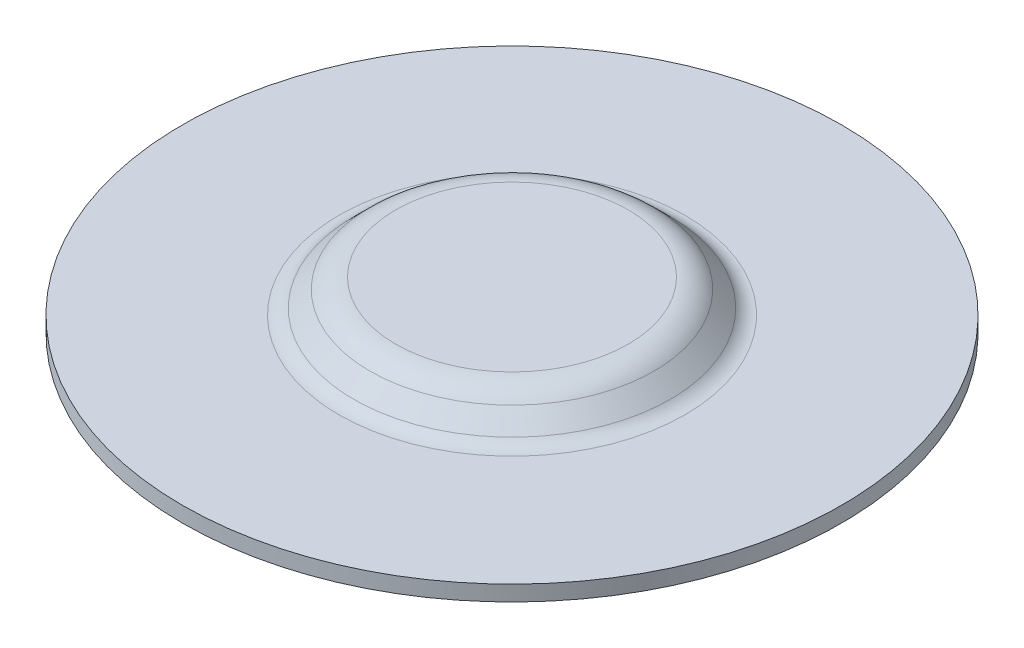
ISO-10303-21;
HEADER;
FILE_DESCRIPTION(('STEP AP214'),'2;1');
FILE_NAME('part.step','',(''),(''),'','','');
FILE_SCHEMA(('AUTOMOTIVE_DESIGN { 1 0 10303 214 1 1 1 1 }'));
ENDSEC;
DATA;
#1=APPLICATION_CONTEXT('core data for automotive mechanical design processes');
#2=APPLICATION_PROTOCOL_DEFINITION('international standard','automotive_design',2000,#1);
#3=PRODUCT_CONTEXT('',#1,'mechanical');
#4=PRODUCT('Part','Part','',(#3));
#5=PRODUCT_RELATED_PRODUCT_CATEGORY('part','',(#4));
#6=PRODUCT_DEFINITION_FORMATION('','',#4);
#7=PRODUCT_DEFINITION_CONTEXT('part definition',#1,'design');
#8=PRODUCT_DEFINITION('design','',#6,#7);
#9=PRODUCT_DEFINITION_SHAPE('','',#8);
#10=(LENGTH_UNIT() NAMED_UNIT(*) SI_UNIT(.MILLI.,.METRE.));
#11=(NAMED_UNIT(*) PLANE_ANGLE_UNIT() SI_UNIT($,.RADIAN.));
#12=(NAMED_UNIT(*) SI_UNIT($,.STERADIAN.) SOLID_ANGLE_UNIT());
#13=UNCERTAINTY_MEASURE_WITH_UNIT(LENGTH_MEASURE(1.E-05),#10,'distance_accuracy_value','');
#14=(GEOMETRIC_REPRESENTATION_CONTEXT(3) GLOBAL_UNCERTAINTY_ASSIGNED_CONTEXT((#13)) GLOBAL_UNIT_ASSIGNED_CONTEXT((#10,
#11,#12)) REPRESENTATION_CONTEXT('',''));
#15=CARTESIAN_POINT('',(0.,0.,0.));
#16=DIRECTION('',(0.,0.,1.));
#17=DIRECTION('',(1.,0.,0.));
#18=AXIS2_PLACEMENT_3D('',#15,#16,#17);
#19=CARTESIAN_POINT('',(0.,-1.1938,0.));
#20=DIRECTION('',(0.,1.,0.));
#21=DIRECTION('',(0.,0.,1.));
#22=AXIS2_PLACEMENT_3D('',#19,#20,#21);
#23=PLANE('',#22);
#24=CARTESIAN_POINT('',(0.,-1.1938,0.));
#25=DIRECTION('',(0.,1.,0.));
#26=DIRECTION('',(0.,0.,1.));
#27=AXIS2_PLACEMENT_3D('',#24,#25,#26);
#28=CIRCLE('',#27,8.9662);
#29=CARTESIAN_POINT('',(0.,-1.1938,8.9662));
#30=VERTEX_POINT('',#29);
#31=EDGE_CURVE('E23',#30,#30,#28,.F.);
#32=ORIENTED_EDGE('',*,*,#31,.T.);
#33=EDGE_LOOP('',(#32));
#34=FACE_BOUND('',#33,.T.);
#35=ADVANCED_FACE('F18',(#34),#23,.F.);
#36=CARTESIAN_POINT('',(0.,-2.79400000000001,0.));
#37=DIRECTION('',(0.,1.,0.));
#38=DIRECTION('',(0.,0.,1.));
#39=AXIS2_PLACEMENT_3D('',#36,#37,#38);
#40=TOROIDAL_SURFACE('',#39,8.9662,1.60020000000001);
#41=ORIENTED_EDGE('',*,*,#31,.F.);
#42=EDGE_LOOP('',(#41));
#43=FACE_BOUND('',#42,.T.);
#44=CARTESIAN_POINT('',(0.,-1.66248772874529,0.));
#45=DIRECTION('',(0.,-1.,0.));
#46=DIRECTION('',(0.,0.,-1.));
#47=AXIS2_PLACEMENT_3D('',#44,#45,#46);
#48=CIRCLE('',#47,10.0977122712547);
#49=CARTESIAN_POINT('',(0.,-1.66248772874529,-10.0977122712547));
#50=VERTEX_POINT('',#49);
#51=EDGE_CURVE('E62',#50,#50,#48,.T.);
#52=ORIENTED_EDGE('',*,*,#51,.T.);
#53=EDGE_LOOP('',(#52));
#54=FACE_BOUND('',#53,.T.);
#55=ADVANCED_FACE('F90',(#43,#54),#40,.F.);
#56=CARTESIAN_POINT('',(0.,0.,0.));
#57=DIRECTION('',(0.,-1.,0.));
#58=DIRECTION('',(0.,0.,-1.));
#59=AXIS2_PLACEMENT_3D('',#56,#57,#58);
#60=PLANE('',#59);
#61=CARTESIAN_POINT('',(0.,0.,0.));
#62=DIRECTION('',(0.,1.,0.));
#63=DIRECTION('',(0.,0.,1.));
#64=AXIS2_PLACEMENT_3D('',#61,#62,#63);
#65=CIRCLE('',#64,8.9662);
#66=CARTESIAN_POINT('',(0.,0.,8.9662));
#67=VERTEX_POINT('',#66);
#68=EDGE_CURVE('E60',#67,#67,#65,.F.);
#69=ORIENTED_EDGE('',*,*,#68,.F.);
#70=EDGE_LOOP('',(#69));
#71=FACE_BOUND('',#70,.T.);
#72=ADVANCED_FACE('F93',(#71),#60,.F.);
#73=CARTESIAN_POINT('',(0.,-2.91545634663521,0.));
#74=DIRECTION('',(0.,-1.,0.));
#75=DIRECTION('',(0.,0.,-1.));
#76=AXIS2_PLACEMENT_3D('',#73,#74,#75);
#77=CONICAL_SURFACE('',#76,11.3506808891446,0.785398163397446);
#78=CARTESIAN_POINT('',(0.,-2.91545634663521,0.));
#79=DIRECTION('',(0.,1.,0.));
#80=DIRECTION('',(0.,0.,-1.));
#81=AXIS2_PLACEMENT_3D('',#78,#79,#80);
#82=CIRCLE('',#81,11.3506808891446);
#83=CARTESIAN_POINT('',(0.,-2.91545634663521,-11.3506808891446));
#84=VERTEX_POINT('',#83);
#85=EDGE_CURVE('E55',#84,#84,#82,.T.);
#86=ORIENTED_EDGE('',*,*,#85,.F.);
#87=EDGE_LOOP('',(#86));
#88=FACE_BOUND('',#87,.T.);
#89=ORIENTED_EDGE('',*,*,#51,.F.);
#90=EDGE_LOOP('',(#89));
#91=FACE_BOUND('',#90,.T.);
#92=ADVANCED_FACE('F88',(#88,#91),#77,.F.);
#93=CARTESIAN_POINT('',(0.,-2.794,0.));
#94=DIRECTION('',(0.,1.,0.));
#95=DIRECTION('',(0.,0.,1.));
#96=AXIS2_PLACEMENT_3D('',#93,#94,#95);
#97=TOROIDAL_SURFACE('',#96,8.9662,2.794);
#98=CARTESIAN_POINT('',(0.,-0.81834365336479,0.));
#99=DIRECTION('',(0.,-1.,0.));
#100=DIRECTION('',(0.,0.,-1.));
#101=AXIS2_PLACEMENT_3D('',#98,#99,#100);
#102=CIRCLE('',#101,10.9418563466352);
#103=CARTESIAN_POINT('',(0.,-0.818343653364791,-10.9418563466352));
#104=VERTEX_POINT('',#103);
#105=EDGE_CURVE('E52',#104,#104,#102,.T.);
#106=ORIENTED_EDGE('',*,*,#105,.F.);
#107=EDGE_LOOP('',(#106));
#108=FACE_BOUND('',#107,.T.);
#109=ORIENTED_EDGE('',*,*,#68,.T.);
#110=EDGE_LOOP('',(#109));
#111=FACE_BOUND('',#110,.T.);
#112=ADVANCED_FACE('F84',(#108,#111),#97,.T.);
#113=CARTESIAN_POINT('',(0.,-0.939800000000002,0.));
#114=DIRECTION('',(0.,1.,0.));
#115=DIRECTION('',(-1.,0.,0.));
#116=AXIS2_PLACEMENT_3D('',#113,#114,#115);
#117=TOROIDAL_SURFACE('',#116,13.3263372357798,2.794);
#118=ORIENTED_EDGE('',*,*,#85,.T.);
#119=EDGE_LOOP('',(#118));
#120=FACE_BOUND('',#119,.T.);
#121=CARTESIAN_POINT('',(0.,-3.7338,13.3263372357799));
#122=CARTESIAN_POINT('',(-0.193940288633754,-3.73379999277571,13.3263629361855));
#123=CARTESIAN_POINT('',(-0.387862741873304,-3.73379999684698,13.3221362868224));
#124=CARTESIAN_POINT('',(-0.775343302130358,-3.73380000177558,13.3052673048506));
#125=CARTESIAN_POINT('',(-0.968901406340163,-3.73380000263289,13.2926249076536));
#126=CARTESIAN_POINT('',(-1.40361828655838,-3.73379997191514,13.2548125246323));
#127=CARTESIAN_POINT('',(-1.64458133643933,-3.7337999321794,13.2273009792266));
#128=CARTESIAN_POINT('',(-1.9775858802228,-3.73379991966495,13.1798041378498));
#129=CARTESIAN_POINT('',(-2.07047173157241,-3.73379992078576,13.1655250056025));
#130=CARTESIAN_POINT('',(-2.3806617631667,-3.73379993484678,13.1144291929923));
#131=CARTESIAN_POINT('',(-2.597245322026,-3.73379996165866,13.0731346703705));
#132=CARTESIAN_POINT('',(-3.05708142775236,-3.73379999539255,12.9735828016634));
#133=CARTESIAN_POINT('',(-3.30000375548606,-3.73379999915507,12.913791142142));
#134=CARTESIAN_POINT('',(-3.60461359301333,-3.73380000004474,12.8297594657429));
#135=CARTESIAN_POINT('',(-3.6680613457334,-3.73380000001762,12.8117538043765));
#136=CARTESIAN_POINT('',(-3.84936484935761,-3.73379999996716,12.7588628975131));
#137=CARTESIAN_POINT('',(-3.96688755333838,-3.73379999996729,12.7228291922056));
#138=CARTESIAN_POINT('',(-4.31788336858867,-3.7337999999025,12.6098592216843));
#139=CARTESIAN_POINT('',(-4.54980658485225,-3.73379999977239,12.5280482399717));
#140=CARTESIAN_POINT('',(-5.00876233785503,-3.73379999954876,12.3517318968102));
#141=CARTESIAN_POINT('',(-5.23579486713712,-3.73379999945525,12.2572265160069));
#142=CARTESIAN_POINT('',(-5.68428600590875,-3.73379999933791,12.0557963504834));
#143=CARTESIAN_POINT('',(-5.90574461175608,-3.73379999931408,11.9488715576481));
#144=CARTESIAN_POINT('',(-6.342406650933,-3.73379999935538,11.7229333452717));
#145=CARTESIAN_POINT('',(-6.557610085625,-3.73379999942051,11.6039199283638));
#146=CARTESIAN_POINT('',(-6.98110039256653,-3.73379999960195,11.3541711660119));
#147=CARTESIAN_POINT('',(-7.18938727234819,-3.73379999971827,11.2234358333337));
#148=CARTESIAN_POINT('',(-7.59841664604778,-3.73379999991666,10.9506327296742));
#149=CARTESIAN_POINT('',(-7.7991591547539,-3.73379999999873,10.8085649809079));
#150=CARTESIAN_POINT('',(-8.11041993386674,-3.73380000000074,10.5750991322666));
#151=CARTESIAN_POINT('',(-8.22364482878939,-3.73379999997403,10.4872845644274));
#152=CARTESIAN_POINT('',(-8.44721070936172,-3.73379999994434,10.3080519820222));
#153=CARTESIAN_POINT('',(-8.55755169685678,-3.73379999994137,10.2166339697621));
#154=CARTESIAN_POINT('',(-8.77523067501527,-3.73379999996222,10.030290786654));
#155=CARTESIAN_POINT('',(-8.8825686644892,-3.73379999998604,9.93536561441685));
#156=CARTESIAN_POINT('',(-9.09412986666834,-3.73380000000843,9.74210748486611));
#157=CARTESIAN_POINT('',(-9.19835307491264,-3.733800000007,9.6437745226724));
#158=CARTESIAN_POINT('',(-9.42410384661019,-3.733799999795,9.42380210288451));
#159=CARTESIAN_POINT('',(-9.54492382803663,-3.73379999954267,9.30143435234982));
#160=CARTESIAN_POINT('',(-9.74792762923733,-3.73379999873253,9.08771332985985));
#161=CARTESIAN_POINT('',(-9.83129446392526,-3.73379999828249,8.99747906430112));
#162=CARTESIAN_POINT('',(-10.0160254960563,-3.73379999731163,8.79189191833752));
#163=CARTESIAN_POINT('',(-10.1166790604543,-3.73379999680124,8.67589864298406));
#164=CARTESIAN_POINT('',(-10.3139122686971,-3.73379999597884,8.44050099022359));
#165=CARTESIAN_POINT('',(-10.4104919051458,-3.73379999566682,8.32109660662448));
#166=CARTESIAN_POINT('',(-10.5994629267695,-3.73379999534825,8.07901760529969));
#167=CARTESIAN_POINT('',(-10.6918543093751,-3.73379999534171,7.95634298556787));
#168=CARTESIAN_POINT('',(-10.8723378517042,-3.73379999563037,7.70787116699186));
#169=CARTESIAN_POINT('',(-10.9604300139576,-3.73379999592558,7.58207396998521));
#170=CARTESIAN_POINT('',(-11.1322091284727,-3.73379999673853,7.32750735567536));
#171=CARTESIAN_POINT('',(-11.2158960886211,-3.73379999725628,7.19873794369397));
#172=CARTESIAN_POINT('',(-11.3787664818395,-3.7337999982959,6.9383821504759));
#173=CARTESIAN_POINT('',(-11.4579499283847,-3.73379999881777,6.8067957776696));
#174=CARTESIAN_POINT('',(-11.6117110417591,-3.7337999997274,6.54096044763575));
#175=CARTESIAN_POINT('',(-11.6862887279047,-3.73380000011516,6.40671150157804));
#176=CARTESIAN_POINT('',(-11.8360892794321,-3.73379999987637,6.12576032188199));
#177=CARTESIAN_POINT('',(-11.9109563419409,-3.73379999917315,5.97886825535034));
#178=CARTESIAN_POINT('',(-12.0642291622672,-3.7338000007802,5.66389275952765));
#179=CARTESIAN_POINT('',(-12.1419076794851,-3.73380000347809,5.49545537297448));
#180=CARTESIAN_POINT('',(-12.2902812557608,-3.73379999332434,5.15552003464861));
#181=CARTESIAN_POINT('',(-12.3609762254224,-3.7337999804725,4.98402204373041));
#182=CARTESIAN_POINT('',(-12.4587247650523,-3.73379997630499,4.73165148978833));
#183=CARTESIAN_POINT('',(-12.4887113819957,-3.73379997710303,4.65190395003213));
#184=CARTESIAN_POINT('',(-12.5804148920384,-3.73379998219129,4.4006763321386));
#185=CARTESIAN_POINT('',(-12.6393680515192,-3.73379998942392,4.22817658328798));
#186=CARTESIAN_POINT('',(-12.7447516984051,-3.73379999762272,3.89783753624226));
#187=CARTESIAN_POINT('',(-12.7918426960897,-3.73379999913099,3.74020817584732));
#188=CARTESIAN_POINT('',(-12.8639428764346,-3.73380000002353,3.48160625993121));
#189=CARTESIAN_POINT('',(-12.8907036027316,-3.73379999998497,3.38111811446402));
#190=CARTESIAN_POINT('',(-12.9685740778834,-3.73380000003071,3.07444673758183));
#191=CARTESIAN_POINT('',(-13.0159774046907,-3.73380000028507,2.86730916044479));
#192=CARTESIAN_POINT('',(-13.1008480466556,-3.73379999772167,2.4510026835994));
#193=CARTESIAN_POINT('',(-13.1383152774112,-3.73379999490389,2.24183376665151));
#194=CARTESIAN_POINT('',(-13.1805088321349,-3.73379998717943,1.96893092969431));
#195=CARTESIAN_POINT('',(-13.1897954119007,-3.73379998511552,1.9058810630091));
#196=CARTESIAN_POINT('',(-13.2074767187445,-3.73379997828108,1.77965481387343));
#197=CARTESIAN_POINT('',(-13.2158714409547,-3.73379997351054,1.71647843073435));
#198=CARTESIAN_POINT('',(-13.2353337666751,-3.73379996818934,1.56112827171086));
#199=CARTESIAN_POINT('',(-13.2458711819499,-3.73379997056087,1.46888819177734));
#200=CARTESIAN_POINT('',(-13.274282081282,-3.73379997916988,1.19467043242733));
#201=CARTESIAN_POINT('',(-13.2893627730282,-3.73379998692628,1.01239598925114));
#202=CARTESIAN_POINT('',(-13.311196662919,-3.73379999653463,0.660441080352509));
#203=CARTESIAN_POINT('',(-13.3184683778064,-3.73379999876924,0.490792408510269));
#204=CARTESIAN_POINT('',(-13.3250703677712,-3.73380000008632,0.214067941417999));
#205=CARTESIAN_POINT('',(-13.3263422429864,-3.73380000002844,0.107034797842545));
#206=CARTESIAN_POINT('',(-13.3263309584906,-3.73379999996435,-0.134184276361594));
#207=CARTESIAN_POINT('',(-13.3243178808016,-3.73379999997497,-0.268371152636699));
#208=CARTESIAN_POINT('',(-13.316228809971,-3.73379999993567,-0.536621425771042));
#209=CARTESIAN_POINT('',(-13.3101528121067,-3.73379999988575,-0.670684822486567));
#210=CARTESIAN_POINT('',(-13.2939571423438,-3.73379999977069,-0.938567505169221));
#211=CARTESIAN_POINT('',(-13.2838374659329,-3.73379999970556,-1.07238679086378));
#212=CARTESIAN_POINT('',(-13.2595599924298,-3.73379999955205,-1.33965867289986));
#213=CARTESIAN_POINT('',(-13.2454021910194,-3.73379999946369,-1.4731112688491));
#214=CARTESIAN_POINT('',(-13.2130623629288,-3.73379999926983,-1.73952810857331));
#215=CARTESIAN_POINT('',(-13.1948803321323,-3.73379999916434,-1.87249235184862));
#216=CARTESIAN_POINT('',(-13.1545083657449,-3.73379999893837,-2.13781111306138));
#217=CARTESIAN_POINT('',(-13.1323184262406,-3.73379999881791,-2.27016563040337));
#218=CARTESIAN_POINT('',(-13.0839509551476,-3.73379999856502,-2.53414416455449));
#219=CARTESIAN_POINT('',(-13.0577734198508,-3.73379999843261,-2.66576818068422));
#220=CARTESIAN_POINT('',(-13.0014546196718,-3.73379999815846,-2.92816559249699));
#221=CARTESIAN_POINT('',(-12.971313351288,-3.73379999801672,-3.05893898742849));
#222=CARTESIAN_POINT('',(-12.9070945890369,-3.73379999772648,-3.31951581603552));
#223=CARTESIAN_POINT('',(-12.8730170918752,-3.73379999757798,-3.4493192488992));
#224=CARTESIAN_POINT('',(-12.8009569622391,-3.73379999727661,-3.70783769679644));
#225=CARTESIAN_POINT('',(-12.7629743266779,-3.73379999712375,-3.83655271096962));
#226=CARTESIAN_POINT('',(-12.6831385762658,-3.73379999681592,-4.09277685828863));
#227=CARTESIAN_POINT('',(-12.6412854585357,-3.73379999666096,-4.22028599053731));
#228=CARTESIAN_POINT('',(-12.5537469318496,-3.73379999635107,-4.47398201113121));
#229=CARTESIAN_POINT('',(-12.508061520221,-3.73379999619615,-4.6001688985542));
#230=CARTESIAN_POINT('',(-12.412900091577,-3.73379999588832,-4.8511052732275));
#231=CARTESIAN_POINT('',(-12.3634240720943,-3.73379999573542,-4.97585475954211));
#232=CARTESIAN_POINT('',(-12.2607265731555,-3.7337999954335,-5.22380248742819));
#233=CARTESIAN_POINT('',(-12.2075050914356,-3.73379999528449,-5.347000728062));
#234=CARTESIAN_POINT('',(-12.0973652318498,-3.73379999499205,-5.59173353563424));
#235=CARTESIAN_POINT('',(-12.0404468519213,-3.73379999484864,-5.7132681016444));
#236=CARTESIAN_POINT('',(-11.9229651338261,-3.73379999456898,-5.95456264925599));
#237=CARTESIAN_POINT('',(-11.8624017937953,-3.73379999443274,-6.07432262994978));
#238=CARTESIAN_POINT('',(-11.7376854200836,-3.73379999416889,-6.31195871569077));
#239=CARTESIAN_POINT('',(-11.6735323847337,-3.73379999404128,-6.42983481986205));
#240=CARTESIAN_POINT('',(-11.5416951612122,-3.73379999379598,-6.66359558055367));
#241=CARTESIAN_POINT('',(-11.474010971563,-3.7337999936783,-6.77948023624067));
#242=CARTESIAN_POINT('',(-11.335173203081,-3.73379999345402,-7.00915234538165));
#243=CARTESIAN_POINT('',(-11.2640196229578,-3.73379999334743,-7.12293979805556));
#244=CARTESIAN_POINT('',(-11.1183080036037,-3.73379999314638,-7.34831366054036));
#245=CARTESIAN_POINT('',(-11.0437499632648,-3.73379999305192,-7.4599000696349));
#246=CARTESIAN_POINT('',(-10.8912974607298,-3.73379999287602,-7.68077001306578));
#247=CARTESIAN_POINT('',(-10.813402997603,-3.73379999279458,-7.7900535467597));
#248=CARTESIAN_POINT('',(-10.6543487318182,-3.73379999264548,-8.00621800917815));
#249=CARTESIAN_POINT('',(-10.5731889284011,-3.73379999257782,-8.11309893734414));
#250=CARTESIAN_POINT('',(-10.407678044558,-3.73379999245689,-8.32436065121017));
#251=CARTESIAN_POINT('',(-10.3233269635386,-3.73379999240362,-8.42874143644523));
#252=CARTESIAN_POINT('',(-10.1515104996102,-3.73379999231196,-8.63490760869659));
#253=CARTESIAN_POINT('',(-10.0640451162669,-3.73379999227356,-8.73669299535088));
#254=CARTESIAN_POINT('',(-9.88607986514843,-3.733799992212,-8.93757548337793));
#255=CARTESIAN_POINT('',(-9.79557999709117,-3.73379999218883,-9.0366725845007));
#256=CARTESIAN_POINT('',(-9.61162836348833,-3.73379999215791,-9.232088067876));
#257=CARTESIAN_POINT('',(-9.51817659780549,-3.73379999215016,-9.32840644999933));
#258=CARTESIAN_POINT('',(-9.32840644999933,-3.73379999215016,-9.51817659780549));
#259=CARTESIAN_POINT('',(-9.232088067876,-3.73379999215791,-9.61162836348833));
#260=CARTESIAN_POINT('',(-9.0366725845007,-3.73379999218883,-9.79557999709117));
#261=CARTESIAN_POINT('',(-8.93757548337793,-3.733799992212,-9.88607986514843));
#262=CARTESIAN_POINT('',(-8.73669299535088,-3.73379999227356,-10.0640451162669));
#263=CARTESIAN_POINT('',(-8.6349076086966,-3.73379999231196,-10.1515104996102));
#264=CARTESIAN_POINT('',(-8.42874143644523,-3.73379999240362,-10.3233269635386));
#265=CARTESIAN_POINT('',(-8.32436065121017,-3.73379999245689,-10.407678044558));
#266=CARTESIAN_POINT('',(-8.11309893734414,-3.73379999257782,-10.5731889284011));
#267=CARTESIAN_POINT('',(-8.00621800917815,-3.73379999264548,-10.6543487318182));
#268=CARTESIAN_POINT('',(-7.7900535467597,-3.73379999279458,-10.813402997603));
#269=CARTESIAN_POINT('',(-7.68077001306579,-3.73379999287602,-10.8912974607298));
#270=CARTESIAN_POINT('',(-7.4599000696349,-3.73379999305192,-11.0437499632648));
#271=CARTESIAN_POINT('',(-7.34831366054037,-3.73379999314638,-11.1183080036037));
#272=CARTESIAN_POINT('',(-7.12293979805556,-3.73379999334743,-11.2640196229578));
#273=CARTESIAN_POINT('',(-7.00915234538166,-3.73379999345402,-11.335173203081));
#274=CARTESIAN_POINT('',(-6.77948023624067,-3.7337999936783,-11.474010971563));
#275=CARTESIAN_POINT('',(-6.66359558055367,-3.73379999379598,-11.5416951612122));
#276=CARTESIAN_POINT('',(-6.42983481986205,-3.73379999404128,-11.6735323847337));
#277=CARTESIAN_POINT('',(-6.31195871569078,-3.73379999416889,-11.7376854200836));
#278=CARTESIAN_POINT('',(-6.07432262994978,-3.73379999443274,-11.8624017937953));
#279=CARTESIAN_POINT('',(-5.95456264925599,-3.73379999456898,-11.9229651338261));
#280=CARTESIAN_POINT('',(-5.71326810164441,-3.73379999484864,-12.0404468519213));
#281=CARTESIAN_POINT('',(-5.59173353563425,-3.73379999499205,-12.0973652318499));
#282=CARTESIAN_POINT('',(-5.34700072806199,-3.73379999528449,-12.2075050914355));
#283=CARTESIAN_POINT('',(-5.22380248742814,-3.7337999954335,-12.2607265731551));
#284=CARTESIAN_POINT('',(-4.97585475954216,-3.73379999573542,-12.3634240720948));
#285=CARTESIAN_POINT('',(-4.8511052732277,-3.73379999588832,-12.4129000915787));
#286=CARTESIAN_POINT('',(-4.600168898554,-3.73379999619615,-12.5080615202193));
#287=CARTESIAN_POINT('',(-4.47398201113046,-3.73379999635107,-12.5537469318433));
#288=CARTESIAN_POINT('',(-4.22028599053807,-3.73379999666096,-12.641285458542));
#289=CARTESIAN_POINT('',(-4.09277685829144,-3.73379999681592,-12.6831385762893));
#290=CARTESIAN_POINT('',(-3.8365527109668,-3.73379999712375,-12.7629743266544));
#291=CARTESIAN_POINT('',(-3.70783769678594,-3.73379999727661,-12.8009569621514));
#292=CARTESIAN_POINT('',(-3.4493192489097,-3.73379999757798,-12.8730170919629));
#293=CARTESIAN_POINT('',(-3.3195158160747,-3.73379999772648,-12.907094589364));
#294=CARTESIAN_POINT('',(-3.05893898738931,-3.73379999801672,-12.9713133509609));
#295=CARTESIAN_POINT('',(-2.92816559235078,-3.73379999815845,-13.0014546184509));
#296=CARTESIAN_POINT('',(-2.66576818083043,-3.73379999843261,-13.0577734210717));
#297=CARTESIAN_POINT('',(-2.53414416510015,-3.73379999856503,-13.0839509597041));
#298=CARTESIAN_POINT('',(-2.27016562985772,-3.73379999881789,-13.1323184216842));
#299=CARTESIAN_POINT('',(-2.13781111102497,-3.73379999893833,-13.15450834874));
#300=CARTESIAN_POINT('',(-1.87249235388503,-3.73379999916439,-13.1948803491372));
#301=CARTESIAN_POINT('',(-1.7395281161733,-3.73379999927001,-13.2130624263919));
#302=CARTESIAN_POINT('',(-1.47311126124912,-3.7337999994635,-13.2454021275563));
#303=CARTESIAN_POINT('',(-1.33965864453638,-3.73379999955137,-13.2595597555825));
#304=CARTESIAN_POINT('',(-1.07238681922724,-3.73379999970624,-13.28383770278));
#305=CARTESIAN_POINT('',(-0.93856761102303,-3.73379999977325,-13.2939580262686));
#306=CARTESIAN_POINT('',(-0.670684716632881,-3.73379999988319,-13.3101519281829));
#307=CARTESIAN_POINT('',(-0.536621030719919,-3.73379999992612,-13.3162255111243));
#308=CARTESIAN_POINT('',(-0.268371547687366,-3.73379999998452,-13.3243211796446));
#309=CARTESIAN_POINT('',(-0.134185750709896,-3.73379999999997,-13.3263432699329));
#310=CARTESIAN_POINT('',(0.,-3.7338,-13.3263372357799));
#311=B_SPLINE_CURVE_WITH_KNOTS('',3,(#121,#122,#123,#124,#125,#126,#127,#128,#129,#130,#131,
#132,#133,#134,#135,#136,#137,#138,#139,#140,#141,#142,#143,#144,#145,#146,#147,#148,#149,#150,
#151,#152,#153,#154,#155,#156,#157,#158,#159,#160,#161,#162,#163,#164,#165,#166,#167,#168,#169,
#170,#171,#172,#173,#174,#175,#176,#177,#178,#179,#180,#181,#182,#183,#184,#185,#186,#187,#188,
#189,#190,#191,#192,#193,#194,#195,#196,#197,#198,#199,#200,#201,#202,#203,#204,#205,#206,#207,
#208,#209,#210,#211,#212,#213,#214,#215,#216,#217,#218,#219,#220,#221,#222,#223,#224,#225,#226,
#227,#228,#229,#230,#231,#232,#233,#234,#235,#236,#237,#238,#239,#240,#241,#242,#243,#244,#245,
#246,#247,#248,#249,#250,#251,#252,#253,#254,#255,#256,#257,#258,#259,#260,#261,#262,#263,#264,
#265,#266,#267,#268,#269,#270,#271,#272,#273,#274,#275,#276,#277,#278,#279,#280,#281,#282,#283,
#284,#285,#286,#287,#288,#289,#290,#291,#292,#293,#294,#295,#296,#297,#298,#299,#300,#301,#302,
#303,#304,#305,#306,#307,#308,#309,#310),.UNSPECIFIED.,.F.,.F.,(4,2,2,2,2,2,2,2,2,2,2,2,2,2,2,2,
2,2,2,2,2,2,2,2,2,2,2,2,2,2,2,2,2,2,2,2,2,2,2,2,2,2,2,2,2,2,2,2,2,2,2,2,2,2,2,2,2,2,2,2,2,2,2,2,
2,2,2,2,2,2,2,2,2,2,2,2,2,2,2,2,2,2,2,2,2,2,2,2,2,2,2,2,2,2,4),(0.,0.581739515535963,
1.16348349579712,1.89064587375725,2.17256402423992,2.83373049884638,3.58380601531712,
3.78166211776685,4.15038727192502,4.88776821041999,5.6251502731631,6.36253281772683,
7.09991520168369,7.83729678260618,8.57467691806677,9.00447434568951,9.43427149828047,
9.86406882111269,10.2938667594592,10.809615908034,11.1781264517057,11.6387575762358,
12.0993895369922,12.5600217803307,13.0206537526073,13.4812849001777,13.941914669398,
14.402542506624,14.8970414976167,15.4533456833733,16.0096569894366,16.2652432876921,
16.8119581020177,17.3053824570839,17.6173321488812,18.2545543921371,18.8917820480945,
19.0829685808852,19.2741561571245,19.5526577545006,20.1011810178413,20.610467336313,
20.9315630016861,21.3341048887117,21.7366472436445,22.1391900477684,22.5417332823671,
22.9442769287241,23.3468209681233,23.7493653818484,24.151910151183,24.5544552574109,
24.9570006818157,25.3595464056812,25.7620924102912,26.1646386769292,26.567185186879,
26.9697319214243,27.3722788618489,27.7748259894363,28.1773732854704,28.5799207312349,
28.9824683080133,29.3850159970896,29.7875637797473,30.1901116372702,30.5926595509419,
30.9952075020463,31.3977554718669,31.8003034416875,32.2028513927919,32.6053993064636,
33.0079471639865,33.4104949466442,33.8130426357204,34.2155902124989,34.6181376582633,
35.0206849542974,35.4232320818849,35.8257790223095,36.2283257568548,36.6308722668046,
37.0334185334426,37.4359645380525,37.8385102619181,38.2410556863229,38.6436007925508,
39.0461455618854,39.4486899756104,39.8512340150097,40.2537776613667,40.6563208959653,
41.0588637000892,41.4614060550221,41.8639479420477),.UNSPECIFIED.);
#312=CARTESIAN_POINT('',(0.,-3.7338,13.3263372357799));
#313=VERTEX_POINT('',#312);
#314=CARTESIAN_POINT('',(0.,-3.7338,-13.3263372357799));
#315=VERTEX_POINT('',#314);
#316=EDGE_CURVE('E46',#313,#315,#311,.T.);
#317=ORIENTED_EDGE('',*,*,#316,.T.);
#318=CARTESIAN_POINT('',(0.,-3.7338,0.));
#319=DIRECTION('',(0.,1.,0.));
#320=DIRECTION('',(-1.,0.,0.));
#321=AXIS2_PLACEMENT_3D('',#318,#319,#320);
#322=CIRCLE('',#321,13.3263372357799);
#323=EDGE_CURVE('E44',#315,#313,#322,.F.);
#324=ORIENTED_EDGE('',*,*,#323,.T.);
#325=EDGE_LOOP('',(#317,#324));
#326=FACE_BOUND('',#325,.T.);
#327=ADVANCED_FACE('F51',(#120,#326),#117,.T.);
#328=CARTESIAN_POINT('',(0.,-2.07131227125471,0.));
#329=DIRECTION('',(0.,-1.,0.));
#330=DIRECTION('',(0.,0.,-1.));
#331=AXIS2_PLACEMENT_3D('',#328,#329,#330);
#332=CONICAL_SURFACE('',#331,12.1948249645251,0.785398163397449);
#333=ORIENTED_EDGE('',*,*,#105,.T.);
#334=EDGE_LOOP('',(#333));
#335=FACE_BOUND('',#334,.T.);
#336=CARTESIAN_POINT('',(0.,-2.07131227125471,0.));
#337=DIRECTION('',(0.,1.,0.));
#338=DIRECTION('',(0.,0.,-1.));
#339=AXIS2_PLACEMENT_3D('',#336,#337,#338);
#340=CIRCLE('',#339,12.1948249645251);
#341=CARTESIAN_POINT('',(0.,-2.07131227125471,-12.1948249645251));
#342=VERTEX_POINT('',#341);
#343=EDGE_CURVE('E49',#342,#342,#340,.T.);
#344=ORIENTED_EDGE('',*,*,#343,.T.);
#345=EDGE_LOOP('',(#344));
#346=FACE_BOUND('',#345,.T.);
#347=ADVANCED_FACE('F83',(#335,#346),#332,.T.);
#348=CARTESIAN_POINT('',(13.3263372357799,-3.7338,0.));
#349=DIRECTION('',(0.,1.,0.));
#350=DIRECTION('',(0.,0.,1.));
#351=AXIS2_PLACEMENT_3D('',#348,#349,#350);
#352=PLANE('',#351);
#353=CARTESIAN_POINT('',(0.,-3.7338,0.));
#354=DIRECTION('',(0.,1.,0.));
#355=DIRECTION('',(0.,0.,1.));
#356=AXIS2_PLACEMENT_3D('',#353,#354,#355);
#357=CIRCLE('',#356,25.4);
#358=CARTESIAN_POINT('',(0.,-3.7338,25.4));
#359=VERTEX_POINT('',#358);
#360=EDGE_CURVE('E58',#359,#359,#357,.T.);
#361=ORIENTED_EDGE('',*,*,#360,.F.);
#362=EDGE_LOOP('',(#361));
#363=FACE_BOUND('',#362,.T.);
#364=ORIENTED_EDGE('',*,*,#323,.F.);
#365=ORIENTED_EDGE('',*,*,#316,.F.);
#366=EDGE_LOOP('',(#364,#365));
#367=FACE_BOUND('',#366,.T.);
#368=ADVANCED_FACE('F47',(#363,#367),#352,.F.);
#369=CARTESIAN_POINT('',(0.,-0.939800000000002,0.));
#370=DIRECTION('',(0.,1.,0.));
#371=DIRECTION('',(-1.,0.,0.));
#372=AXIS2_PLACEMENT_3D('',#369,#370,#371);
#373=TOROIDAL_SURFACE('',#372,13.3263372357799,1.6002);
#374=CARTESIAN_POINT('',(0.,-2.54,-13.3263372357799));
#375=CARTESIAN_POINT('',(-0.193941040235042,-2.53999998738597,-13.3263629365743));
#376=CARTESIAN_POINT('',(-0.387864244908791,-2.53999999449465,-13.3221362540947));
#377=CARTESIAN_POINT('',(-0.775345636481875,-2.54000000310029,-13.305267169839));
#378=CARTESIAN_POINT('',(-0.968903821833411,-2.54000000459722,-13.2926247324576));
#379=CARTESIAN_POINT('',(-1.40361994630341,-2.53999995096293,-13.2548123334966));
#380=CARTESIAN_POINT('',(-1.64458216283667,-2.53999988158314,-13.2273008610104));
#381=CARTESIAN_POINT('',(-1.97758579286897,-2.53999985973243,-13.179804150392));
#382=CARTESIAN_POINT('',(-2.07047155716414,-2.53999986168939,-13.1655250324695));
#383=CARTESIAN_POINT('',(-2.38066158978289,-2.53999988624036,-13.1144292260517));
#384=CARTESIAN_POINT('',(-2.59724523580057,-2.53999993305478,-13.0731346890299));
#385=CARTESIAN_POINT('',(-3.05708143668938,-2.53999999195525,-12.9735827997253));
#386=CARTESIAN_POINT('',(-3.30000377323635,-2.53999999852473,-12.9137911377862));
#387=CARTESIAN_POINT('',(-3.60461361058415,-2.54000000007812,-12.8297594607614));
#388=CARTESIAN_POINT('',(-3.66806135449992,-2.54000000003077,-12.8117538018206));
#389=CARTESIAN_POINT('',(-3.84936484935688,-2.53999999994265,-12.7588628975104));
#390=CARTESIAN_POINT('',(-3.96688755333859,-2.53999999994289,-12.7228291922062));
#391=CARTESIAN_POINT('',(-4.31788336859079,-2.53999999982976,-12.6098592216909));
#392=CARTESIAN_POINT('',(-4.54980658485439,-2.53999999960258,-12.5280482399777));
#393=CARTESIAN_POINT('',(-5.00876233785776,-2.53999999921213,-12.3517318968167));
#394=CARTESIAN_POINT('',(-5.2357948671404,-2.53999999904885,-12.2572265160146));
#395=CARTESIAN_POINT('',(-5.68428600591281,-2.53999999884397,-12.0557963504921));
#396=CARTESIAN_POINT('',(-5.90574461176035,-2.53999999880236,-11.9488715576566));
#397=CARTESIAN_POINT('',(-6.34240665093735,-2.53999999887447,-11.7229333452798));
#398=CARTESIAN_POINT('',(-6.55761008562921,-2.53999999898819,-11.6039199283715));
#399=CARTESIAN_POINT('',(-6.98110039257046,-2.539999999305,-11.354171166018));
#400=CARTESIAN_POINT('',(-7.18938727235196,-2.53999999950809,-11.2234358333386));
#401=CARTESIAN_POINT('',(-7.59841664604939,-2.53999999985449,-10.9506327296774));
#402=CARTESIAN_POINT('',(-7.7991591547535,-2.53999999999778,-10.8085649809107));
#403=CARTESIAN_POINT('',(-8.11041994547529,-2.54000000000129,-10.5750991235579));
#404=CARTESIAN_POINT('',(-8.22364485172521,-2.53999999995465,-10.4872845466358));
#405=CARTESIAN_POINT('',(-8.44721074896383,-2.53999999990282,-10.3080519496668));
#406=CARTESIAN_POINT('',(-8.55755174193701,-2.53999999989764,-10.2166339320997));
#407=CARTESIAN_POINT('',(-8.77523072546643,-2.53999999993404,-10.0302907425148));
#408=CARTESIAN_POINT('',(-8.88256871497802,-2.53999999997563,-9.93536556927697));
#409=CARTESIAN_POINT('',(-9.0941299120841,-2.54000000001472,-9.7421074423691));
#410=CARTESIAN_POINT('',(-9.19835311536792,-2.54000000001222,-9.64377448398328));
#411=CARTESIAN_POINT('',(-9.42410386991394,-2.53999999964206,-9.42380207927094));
#412=CARTESIAN_POINT('',(-9.54492383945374,-2.53999999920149,-9.30143434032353));
#413=CARTESIAN_POINT('',(-9.74792763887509,-2.53999999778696,-9.08771331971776));
#414=CARTESIAN_POINT('',(-9.8312944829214,-2.53999999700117,-8.99747904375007));
#415=CARTESIAN_POINT('',(-10.0160255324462,-2.53999999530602,-8.79189187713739));
#416=CARTESIAN_POINT('',(-10.1166791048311,-2.53999999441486,-8.67589859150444));
#417=CARTESIAN_POINT('',(-10.3139123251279,-2.53999999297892,-8.44050092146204));
#418=CARTESIAN_POINT('',(-10.4104919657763,-2.53999999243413,-8.32109653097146));
#419=CARTESIAN_POINT('',(-10.5994629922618,-2.5399999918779,-8.07901751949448));
#420=CARTESIAN_POINT('',(-10.6918543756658,-2.53999999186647,-7.95634289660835));
#421=CARTESIAN_POINT('',(-10.8723379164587,-2.53999999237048,-7.70787107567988));
#422=CARTESIAN_POINT('',(-10.9604300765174,-2.53999999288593,-7.58207387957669));
#423=CARTESIAN_POINT('',(-11.1322091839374,-2.53999999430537,-7.32750727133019));
#424=CARTESIAN_POINT('',(-11.2158961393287,-2.53999999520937,-7.1987378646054));
#425=CARTESIAN_POINT('',(-11.3787665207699,-2.53999999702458,-6.93838208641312));
#426=CARTESIAN_POINT('',(-11.4579499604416,-2.53999999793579,-6.80679572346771));
#427=CARTESIAN_POINT('',(-11.6117110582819,-2.53999999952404,-6.54096041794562));
#428=CARTESIAN_POINT('',(-11.6862887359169,-2.54000000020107,-6.40671148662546));
#429=CARTESIAN_POINT('',(-11.8360894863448,-2.53999999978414,-6.12575993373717));
#430=CARTESIAN_POINT('',(-11.9109567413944,-2.53999999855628,-5.97886747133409));
#431=CARTESIAN_POINT('',(-12.0642297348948,-2.54000000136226,-5.66389153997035));
#432=CARTESIAN_POINT('',(-12.1419082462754,-2.5400000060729,-5.49545412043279));
#433=CARTESIAN_POINT('',(-12.2902816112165,-2.5399999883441,-5.15551916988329));
#434=CARTESIAN_POINT('',(-12.3609763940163,-2.53999996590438,-4.98402160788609));
#435=CARTESIAN_POINT('',(-12.4587247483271,-2.53999995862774,-4.73165153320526));
#436=CARTESIAN_POINT('',(-12.488711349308,-2.53999996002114,-4.6519040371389));
#437=CARTESIAN_POINT('',(-12.5804148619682,-2.53999996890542,-4.40067642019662));
#438=CARTESIAN_POINT('',(-12.6393680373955,-2.53999998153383,-4.22817662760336));
#439=CARTESIAN_POINT('',(-12.7447516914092,-2.53999999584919,-3.89783755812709));
#440=CARTESIAN_POINT('',(-12.7918426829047,-2.53999999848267,-3.74020821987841));
#441=CARTESIAN_POINT('',(-12.8639428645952,-2.54000000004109,-3.48160630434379));
#442=CARTESIAN_POINT('',(-12.8907035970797,-2.53999999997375,-3.38111813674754));
#443=CARTESIAN_POINT('',(-12.9685741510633,-2.54000000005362,-3.07444644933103));
#444=CARTESIAN_POINT('',(-13.0159775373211,-2.54000000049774,-2.8673085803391));
#445=CARTESIAN_POINT('',(-13.1008481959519,-2.53999999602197,-2.45100187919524));
#446=CARTESIAN_POINT('',(-13.1383154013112,-2.53999999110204,-2.24183303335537));
#447=CARTESIAN_POINT('',(-13.1805089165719,-2.53999997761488,-1.96893036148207));
#448=CARTESIAN_POINT('',(-13.1897954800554,-2.53999997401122,-1.90588058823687));
#449=CARTESIAN_POINT('',(-13.2074767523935,-2.53999996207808,-1.77965455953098));
#450=CARTESIAN_POINT('',(-13.2158714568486,-2.53999995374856,-1.71647830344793));
#451=CARTESIAN_POINT('',(-13.2353337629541,-2.53999994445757,-1.56112830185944));
#452=CARTESIAN_POINT('',(-13.2458711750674,-2.53999994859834,-1.46888825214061));
#453=CARTESIAN_POINT('',(-13.2742820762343,-2.53999996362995,-1.19467049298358));
#454=CARTESIAN_POINT('',(-13.2893627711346,-2.53999997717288,-1.01239601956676));
#455=CARTESIAN_POINT('',(-13.3111966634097,-2.53999999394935,-0.660441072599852));
#456=CARTESIAN_POINT('',(-13.3184683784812,-2.53999999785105,-0.490792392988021));
#457=CARTESIAN_POINT('',(-13.3250703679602,-2.54000000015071,-0.214067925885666));
#458=CARTESIAN_POINT('',(-13.3263422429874,-2.54000000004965,-0.107034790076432));
#459=CARTESIAN_POINT('',(-13.3263309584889,-2.53999999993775,0.134184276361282));
#460=CARTESIAN_POINT('',(-13.3243178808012,-2.5399999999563,0.268371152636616));
#461=CARTESIAN_POINT('',(-13.3162288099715,-2.53999999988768,0.536621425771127));
#462=CARTESIAN_POINT('',(-13.3101528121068,-2.53999999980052,0.670684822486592));
#463=CARTESIAN_POINT('',(-13.2939571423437,-2.53999999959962,0.9385675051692));
#464=CARTESIAN_POINT('',(-13.2838374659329,-2.53999999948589,1.07238679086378));
#465=CARTESIAN_POINT('',(-13.2595599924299,-2.53999999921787,1.33965867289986));
#466=CARTESIAN_POINT('',(-13.2454021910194,-2.53999999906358,1.47311126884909));
#467=CARTESIAN_POINT('',(-13.2130623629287,-2.5399999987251,1.7395281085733));
#468=CARTESIAN_POINT('',(-13.1948803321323,-2.5399999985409,1.87249235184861));
#469=CARTESIAN_POINT('',(-13.1545083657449,-2.53999999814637,2.13781111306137));
#470=CARTESIAN_POINT('',(-13.1323184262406,-2.53999999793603,2.27016563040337));
#471=CARTESIAN_POINT('',(-13.0839509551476,-2.53999999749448,2.53414416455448));
#472=CARTESIAN_POINT('',(-13.0577734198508,-2.53999999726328,2.6657681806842));
#473=CARTESIAN_POINT('',(-13.0014546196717,-2.53999999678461,2.92816559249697));
#474=CARTESIAN_POINT('',(-12.971313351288,-2.53999999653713,3.05893898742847));
#475=CARTESIAN_POINT('',(-12.9070945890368,-2.53999999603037,3.31951581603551));
#476=CARTESIAN_POINT('',(-12.8730170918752,-2.53999999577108,3.44931924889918));
#477=CARTESIAN_POINT('',(-12.800956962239,-2.53999999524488,3.70783769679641));
#478=CARTESIAN_POINT('',(-12.7629743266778,-2.53999999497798,3.83655271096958));
#479=CARTESIAN_POINT('',(-12.6831385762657,-2.5399999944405,4.09277685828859));
#480=CARTESIAN_POINT('',(-12.6412854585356,-2.53999999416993,4.22028599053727));
#481=CARTESIAN_POINT('',(-12.5537469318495,-2.53999999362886,4.47398201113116));
#482=CARTESIAN_POINT('',(-12.5080615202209,-2.53999999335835,4.60016889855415));
#483=CARTESIAN_POINT('',(-12.4129000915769,-2.53999999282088,4.85110527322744));
#484=CARTESIAN_POINT('',(-12.3634240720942,-2.53999999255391,4.97585475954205));
#485=CARTESIAN_POINT('',(-12.2607265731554,-2.53999999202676,5.22380248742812));
#486=CARTESIAN_POINT('',(-12.2075050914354,-2.53999999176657,5.34700072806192));
#487=CARTESIAN_POINT('',(-12.0973652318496,-2.53999999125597,5.59173353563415));
#488=CARTESIAN_POINT('',(-12.0404468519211,-2.53999999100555,5.71326810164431));
#489=CARTESIAN_POINT('',(-11.9229651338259,-2.53999999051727,5.95456264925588));
#490=CARTESIAN_POINT('',(-11.8624017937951,-2.53999999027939,6.07432262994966));
#491=CARTESIAN_POINT('',(-11.7376854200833,-2.5399999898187,6.31195871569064));
#492=CARTESIAN_POINT('',(-11.6735323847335,-2.53999998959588,6.42983481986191));
#493=CARTESIAN_POINT('',(-11.541695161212,-2.53999998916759,6.66359558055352));
#494=CARTESIAN_POINT('',(-11.4740109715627,-2.5399999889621,6.77948023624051));
#495=CARTESIAN_POINT('',(-11.3351732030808,-2.53999998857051,7.00915234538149));
#496=CARTESIAN_POINT('',(-11.2640196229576,-2.53999998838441,7.12293979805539));
#497=CARTESIAN_POINT('',(-11.1183080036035,-2.53999998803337,7.34831366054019));
#498=CARTESIAN_POINT('',(-11.0437499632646,-2.53999998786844,7.45990006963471));
#499=CARTESIAN_POINT('',(-10.8912974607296,-2.53999998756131,7.68077001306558));
#500=CARTESIAN_POINT('',(-10.8134029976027,-2.53999998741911,7.79005354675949));
#501=CARTESIAN_POINT('',(-10.6543487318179,-2.53999998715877,8.00621800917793));
#502=CARTESIAN_POINT('',(-10.5731889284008,-2.53999998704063,8.11309893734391));
#503=CARTESIAN_POINT('',(-10.4076780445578,-2.53999998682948,8.32436065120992));
#504=CARTESIAN_POINT('',(-10.3233269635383,-2.53999998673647,8.42874143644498));
#505=CARTESIAN_POINT('',(-10.1515104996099,-2.53999998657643,8.63490760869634));
#506=CARTESIAN_POINT('',(-10.0640451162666,-2.5399999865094,8.73669299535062));
#507=CARTESIAN_POINT('',(-9.88607986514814,-2.5399999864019,8.93757548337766));
#508=CARTESIAN_POINT('',(-9.79557999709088,-2.53999998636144,9.03667258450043));
#509=CARTESIAN_POINT('',(-9.61162836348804,-2.53999998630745,9.23208806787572));
#510=CARTESIAN_POINT('',(-9.5181765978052,-2.53999998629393,9.32840644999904));
#511=CARTESIAN_POINT('',(-9.32840644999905,-2.53999998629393,9.5181765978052));
#512=CARTESIAN_POINT('',(-9.23208806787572,-2.53999998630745,9.61162836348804));
#513=CARTESIAN_POINT('',(-9.03667258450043,-2.53999998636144,9.79557999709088));
#514=CARTESIAN_POINT('',(-8.93757548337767,-2.5399999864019,9.88607986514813));
#515=CARTESIAN_POINT('',(-8.73669299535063,-2.5399999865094,10.0640451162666));
#516=CARTESIAN_POINT('',(-8.63490760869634,-2.53999998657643,10.1515104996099));
#517=CARTESIAN_POINT('',(-8.42874143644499,-2.53999998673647,10.3233269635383));
#518=CARTESIAN_POINT('',(-8.32436065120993,-2.53999998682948,10.4076780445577));
#519=CARTESIAN_POINT('',(-8.11309893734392,-2.53999998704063,10.5731889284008));
#520=CARTESIAN_POINT('',(-8.00621800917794,-2.53999998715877,10.6543487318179));
#521=CARTESIAN_POINT('',(-7.7900535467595,-2.53999998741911,10.8134029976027));
#522=CARTESIAN_POINT('',(-7.68077001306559,-2.53999998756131,10.8912974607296));
#523=CARTESIAN_POINT('',(-7.45990006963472,-2.53999998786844,11.0437499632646));
#524=CARTESIAN_POINT('',(-7.34831366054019,-2.53999998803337,11.1183080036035));
#525=CARTESIAN_POINT('',(-7.1229397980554,-2.53999998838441,11.2640196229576));
#526=CARTESIAN_POINT('',(-7.0091523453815,-2.53999998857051,11.3351732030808));
#527=CARTESIAN_POINT('',(-6.77948023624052,-2.5399999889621,11.4740109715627));
#528=CARTESIAN_POINT('',(-6.66359558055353,-2.53999998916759,11.541695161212));
#529=CARTESIAN_POINT('',(-6.42983481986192,-2.53999998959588,11.6735323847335));
#530=CARTESIAN_POINT('',(-6.31195871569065,-2.5399999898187,11.7376854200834));
#531=CARTESIAN_POINT('',(-6.07432262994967,-2.5399999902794,11.8624017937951));
#532=CARTESIAN_POINT('',(-5.95456264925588,-2.53999999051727,11.9229651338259));
#533=CARTESIAN_POINT('',(-5.71326810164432,-2.53999999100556,12.0404468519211));
#534=CARTESIAN_POINT('',(-5.59173353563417,-2.53999999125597,12.0973652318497));
#535=CARTESIAN_POINT('',(-5.34700072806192,-2.53999999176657,12.2075050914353));
#536=CARTESIAN_POINT('',(-5.22380248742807,-2.53999999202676,12.2607265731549));
#537=CARTESIAN_POINT('',(-4.97585475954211,-2.53999999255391,12.3634240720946));
#538=CARTESIAN_POINT('',(-4.85110527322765,-2.53999999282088,12.4129000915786));
#539=CARTESIAN_POINT('',(-4.60016889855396,-2.53999999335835,12.5080615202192));
#540=CARTESIAN_POINT('',(-4.47398201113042,-2.53999999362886,12.5537469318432));
#541=CARTESIAN_POINT('',(-4.22028599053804,-2.53999999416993,12.6412854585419));
#542=CARTESIAN_POINT('',(-4.09277685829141,-2.5399999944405,12.6831385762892));
#543=CARTESIAN_POINT('',(-3.83655271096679,-2.53999999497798,12.7629743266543));
#544=CARTESIAN_POINT('',(-3.70783769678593,-2.53999999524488,12.8009569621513));
#545=CARTESIAN_POINT('',(-3.44931924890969,-2.53999999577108,12.8730170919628));
#546=CARTESIAN_POINT('',(-3.31951581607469,-2.53999999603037,12.9070945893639));
#547=CARTESIAN_POINT('',(-3.0589389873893,-2.53999999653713,12.9713133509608));
#548=CARTESIAN_POINT('',(-2.92816559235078,-2.5399999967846,13.0014546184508));
#549=CARTESIAN_POINT('',(-2.66576818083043,-2.53999999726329,13.0577734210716));
#550=CARTESIAN_POINT('',(-2.53414416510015,-2.53999999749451,13.083950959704));
#551=CARTESIAN_POINT('',(-2.27016562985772,-2.539999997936,13.1323184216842));
#552=CARTESIAN_POINT('',(-2.13781111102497,-2.53999999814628,13.15450834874));
#553=CARTESIAN_POINT('',(-1.87249235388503,-2.53999999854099,13.1948803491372));
#554=CARTESIAN_POINT('',(-1.7395281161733,-2.53999999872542,13.2130624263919));
#555=CARTESIAN_POINT('',(-1.47311126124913,-2.53999999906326,13.2454021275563));
#556=CARTESIAN_POINT('',(-1.33965864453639,-2.53999999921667,13.2595597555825));
#557=CARTESIAN_POINT('',(-1.07238681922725,-2.53999999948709,13.28383770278));
#558=CARTESIAN_POINT('',(-0.938567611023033,-2.53999999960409,13.2939580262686));
#559=CARTESIAN_POINT('',(-0.670684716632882,-2.53999999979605,13.3101519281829));
#560=CARTESIAN_POINT('',(-0.536621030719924,-2.53999999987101,13.3162255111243));
#561=CARTESIAN_POINT('',(-0.268371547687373,-2.53999999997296,13.3243211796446));
#562=CARTESIAN_POINT('',(-0.134185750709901,-2.53999999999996,13.3263432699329));
#563=CARTESIAN_POINT('',(0.,-2.54,13.3263372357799));
#564=B_SPLINE_CURVE_WITH_KNOTS('',3,(#374,#375,#376,#377,#378,#379,#380,#381,#382,#383,#384,
#385,#386,#387,#388,#389,#390,#391,#392,#393,#394,#395,#396,#397,#398,#399,#400,#401,#402,#403,
#404,#405,#406,#407,#408,#409,#410,#411,#412,#413,#414,#415,#416,#417,#418,#419,#420,#421,#422,
#423,#424,#425,#426,#427,#428,#429,#430,#431,#432,#433,#434,#435,#436,#437,#438,#439,#440,#441,
#442,#443,#444,#445,#446,#447,#448,#449,#450,#451,#452,#453,#454,#455,#456,#457,#458,#459,#460,
#461,#462,#463,#464,#465,#466,#467,#468,#469,#470,#471,#472,#473,#474,#475,#476,#477,#478,#479,
#480,#481,#482,#483,#484,#485,#486,#487,#488,#489,#490,#491,#492,#493,#494,#495,#496,#497,#498,
#499,#500,#501,#502,#503,#504,#505,#506,#507,#508,#509,#510,#511,#512,#513,#514,#515,#516,#517,
#518,#519,#520,#521,#522,#523,#524,#525,#526,#527,#528,#529,#530,#531,#532,#533,#534,#535,#536,
#537,#538,#539,#540,#541,#542,#543,#544,#545,#546,#547,#548,#549,#550,#551,#552,#553,#554,#555,
#556,#557,#558,#559,#560,#561,#562,#563),.UNSPECIFIED.,.F.,.F.,(4,2,2,2,2,2,2,2,2,2,2,2,2,2,2,2,
2,2,2,2,2,2,2,2,2,2,2,2,2,2,2,2,2,2,2,2,2,2,2,2,2,2,2,2,2,2,2,2,2,2,2,2,2,2,2,2,2,2,2,2,2,2,2,2,
2,2,2,2,2,2,2,2,2,2,2,2,2,2,2,2,2,2,2,2,2,2,2,2,2,2,2,2,2,2,4),(0.,0.581741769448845,
1.1634860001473,1.89064587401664,2.17256375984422,2.83373049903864,3.58380604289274,
3.78166211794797,4.15038727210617,4.88776821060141,5.62515027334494,6.36253281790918,
7.09991520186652,7.83729678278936,8.5746769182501,9.00447438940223,9.43427156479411,
9.86406888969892,10.2938668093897,10.809615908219,11.178126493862,11.6387576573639,
12.0993896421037,12.5600218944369,13.0206538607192,13.4812849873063,13.9419147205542,
14.4025425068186,14.8970428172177,15.4533470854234,16.0096569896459,16.2652431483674,
16.8119581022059,17.3053823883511,17.6173321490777,18.2545552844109,18.8917827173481,
19.0829689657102,19.2741561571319,19.5526576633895,20.1011810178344,20.6104673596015,
20.9315630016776,21.3341048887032,21.7366472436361,22.1391900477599,22.5417332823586,
22.9442769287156,23.3468209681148,23.7493653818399,24.1519101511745,24.5544552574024,
24.9570006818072,25.3595464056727,25.7620924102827,26.1646386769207,26.5671851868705,
26.9697319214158,27.3722788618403,27.7748259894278,28.1773732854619,28.5799207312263,
28.9824683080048,29.385015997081,29.7875637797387,30.1901116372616,30.5926595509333,
30.9952075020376,31.3977554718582,31.8003034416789,32.2028513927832,32.6053993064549,
33.0079471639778,33.4104949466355,33.8130426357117,34.2155902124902,34.6181376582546,
35.0206849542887,35.4232320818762,35.8257790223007,36.228325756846,36.6308722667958,
37.0334185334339,37.4359645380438,37.8385102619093,38.2410556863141,38.643600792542,
39.0461455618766,39.4486899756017,39.8512340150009,40.2537776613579,40.6563208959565,
41.0588637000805,41.4614060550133,41.8639479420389),.UNSPECIFIED.);
#565=CARTESIAN_POINT('',(0.,-2.54,-13.3263372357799));
#566=VERTEX_POINT('',#565);
#567=CARTESIAN_POINT('',(0.,-2.54,13.3263372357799));
#568=VERTEX_POINT('',#567);
#569=EDGE_CURVE('E29',#566,#568,#564,.T.);
#570=ORIENTED_EDGE('',*,*,#569,.T.);
#571=CARTESIAN_POINT('',(0.,-2.54,0.));
#572=DIRECTION('',(0.,1.,0.));
#573=DIRECTION('',(-1.,0.,0.));
#574=AXIS2_PLACEMENT_3D('',#571,#572,#573);
#575=CIRCLE('',#574,13.3263372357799);
#576=EDGE_CURVE('E121',#568,#566,#575,.T.);
#577=ORIENTED_EDGE('',*,*,#576,.T.);
#578=EDGE_LOOP('',(#570,#577));
#579=FACE_BOUND('',#578,.T.);
#580=ORIENTED_EDGE('',*,*,#343,.F.);
#581=EDGE_LOOP('',(#580));
#582=FACE_BOUND('',#581,.T.);
#583=ADVANCED_FACE('F20',(#579,#582),#373,.F.);
#584=CARTESIAN_POINT('',(0.,-3.7350539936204,0.));
#585=DIRECTION('',(0.,1.,0.));
#586=DIRECTION('',(0.,0.,1.));
#587=AXIS2_PLACEMENT_3D('',#584,#585,#586);
#588=CYLINDRICAL_SURFACE('',#587,25.4);
#589=ORIENTED_EDGE('',*,*,#360,.T.);
#590=EDGE_LOOP('',(#589));
#591=FACE_BOUND('',#590,.T.);
#592=CARTESIAN_POINT('',(0.,-2.54,0.));
#593=DIRECTION('',(0.,1.,0.));
#594=DIRECTION('',(0.,0.,1.));
#595=AXIS2_PLACEMENT_3D('',#592,#593,#594);
#596=CIRCLE('',#595,25.4);
#597=CARTESIAN_POINT('',(0.,-2.54,25.4));
#598=VERTEX_POINT('',#597);
#599=EDGE_CURVE('E11',#598,#598,#596,.F.);
#600=ORIENTED_EDGE('',*,*,#599,.T.);
#601=EDGE_LOOP('',(#600));
#602=FACE_BOUND('',#601,.T.);
#603=ADVANCED_FACE('F110',(#591,#602),#588,.T.);
#604=CARTESIAN_POINT('',(13.3263372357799,-2.54,0.));
#605=DIRECTION('',(0.,-1.,0.));
#606=DIRECTION('',(0.,0.,-1.));
#607=AXIS2_PLACEMENT_3D('',#604,#605,#606);
#608=PLANE('',#607);
#609=ORIENTED_EDGE('',*,*,#599,.F.);
#610=EDGE_LOOP('',(#609));
#611=FACE_BOUND('',#610,.T.);
#612=ORIENTED_EDGE('',*,*,#576,.F.);
#613=ORIENTED_EDGE('',*,*,#569,.F.);
#614=EDGE_LOOP('',(#612,#613));
#615=FACE_BOUND('',#614,.T.);
#616=ADVANCED_FACE('F113',(#611,#615),#608,.F.);
#617=CLOSED_SHELL('',(#35,#55,#72,#92,#112,#327,#347,#368,#583,#603,#616));
#618=MANIFOLD_SOLID_BREP('B1',#617);
#619=ADVANCED_BREP_SHAPE_REPRESENTATION('',(#18,#618),#14);
#620=SHAPE_DEFINITION_REPRESENTATION(#9,#619);
ENDSEC;
END-ISO-10303-21;
